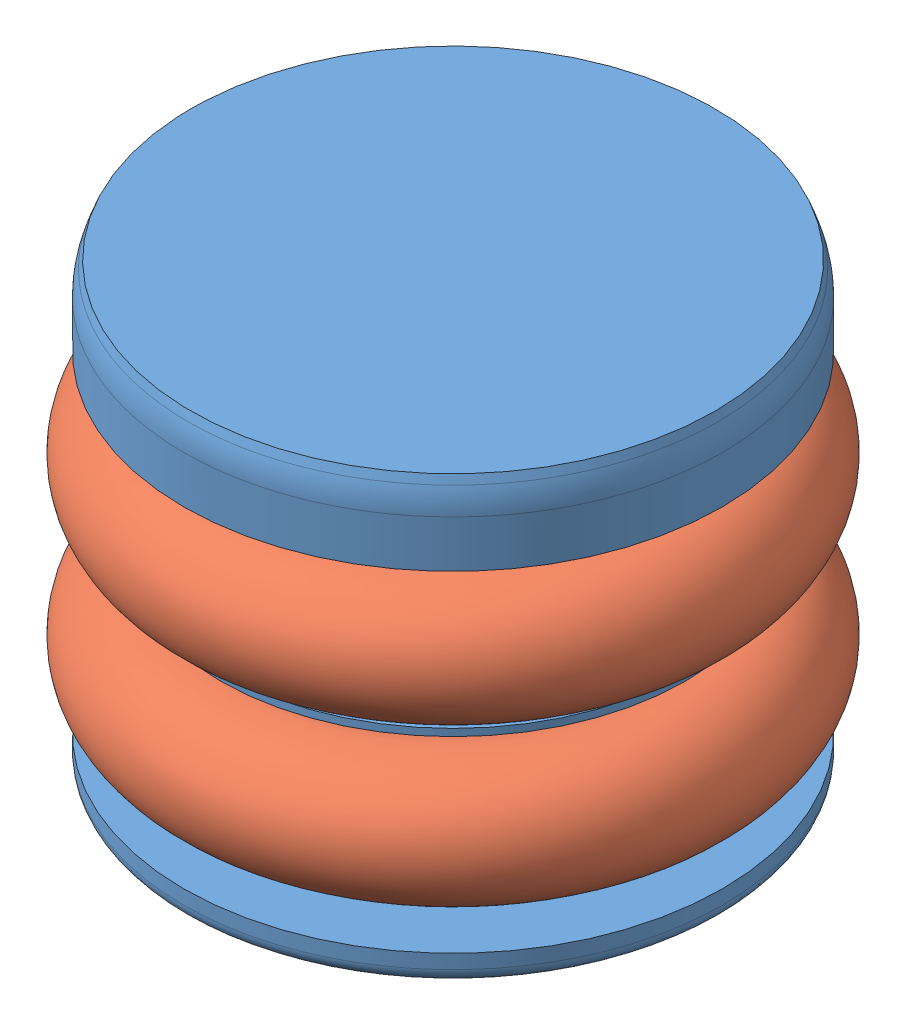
SolidWorks assembly 020400_AR_plunger.SLDASM, configuration vent (file format 15000). Lengths in mm.
Overall size (8.55 8 8.55).
3 component instances, 2 part files, 5 mates.
Components (placement in the parent):
- 020401_AR_plunger-1: 020401_AR_plunger.SLDPRT [4.7] at (-0.6512 1.6625 -7.5098) size (7.52 8 7.52)
- 029902_o-ring-008-1: 029902_o-ring-008.SLDPRT [Default] at (-0.6512 -2.8675 -7.5098) x (0.99772 0 0.067488) z (-0.067488 0 0.99772) size (8.03 1.78 8.03)
- 029902_o-ring-008-3: 029902_o-ring-008.SLDPRT [Default] at (-0.6512 -0.6675 -7.5098) x (0.99772 0 0.067488) z (-0.067488 0 0.99772) size (8.03 1.78 8.03)
Mates (geometry in assembly coordinates):
- Coincident1: coincident anti-aligned: axis of 020401_AR_plunger-1 through (-0.6512 -1.8075 -7.5098) axis (0 1 0); line of 029902_o-ring-008-1 through (-0.6512 -0.5696 -7.5098) axis (0 -1 0)
- Distance1: distance = 1.2 mm aligned: plane of A0_plunger-1 through (3.1088 -4.0675 -7.5098) normal (0 1 0); plane of comp_o-ring-008-1 through (-0.6512 -2.8675 -7.5098) normal (0 1 0)
- Coincident2: coincident: line of assembly; axis of 029902_o-ring-008-1 through (-0.6512 -0.5696 -7.5098) axis (0 -1 0); axis of 020401_AR_plunger-1 through (-0.6512 -4.0675 -7.5098) axis (0 1 0)
- Distance3: distance = 1.2 mm aligned: plane of 020401_AR_plunger-1 through (3.1088 -4.0675 -7.5098) normal (0 1 0); plane of comp_o-ring-008-1 through (-0.6512 -2.8675 -7.5098) normal (0 1 0)
- Coincident6: coincident anti-aligned: line of 020401_AR_plunger-1 through (-0.6512 -4.0675 -7.5098) axis (0 1 0); line of ? through (-1.6837 2.2204 -8.5282) axis (0 -1 0)
